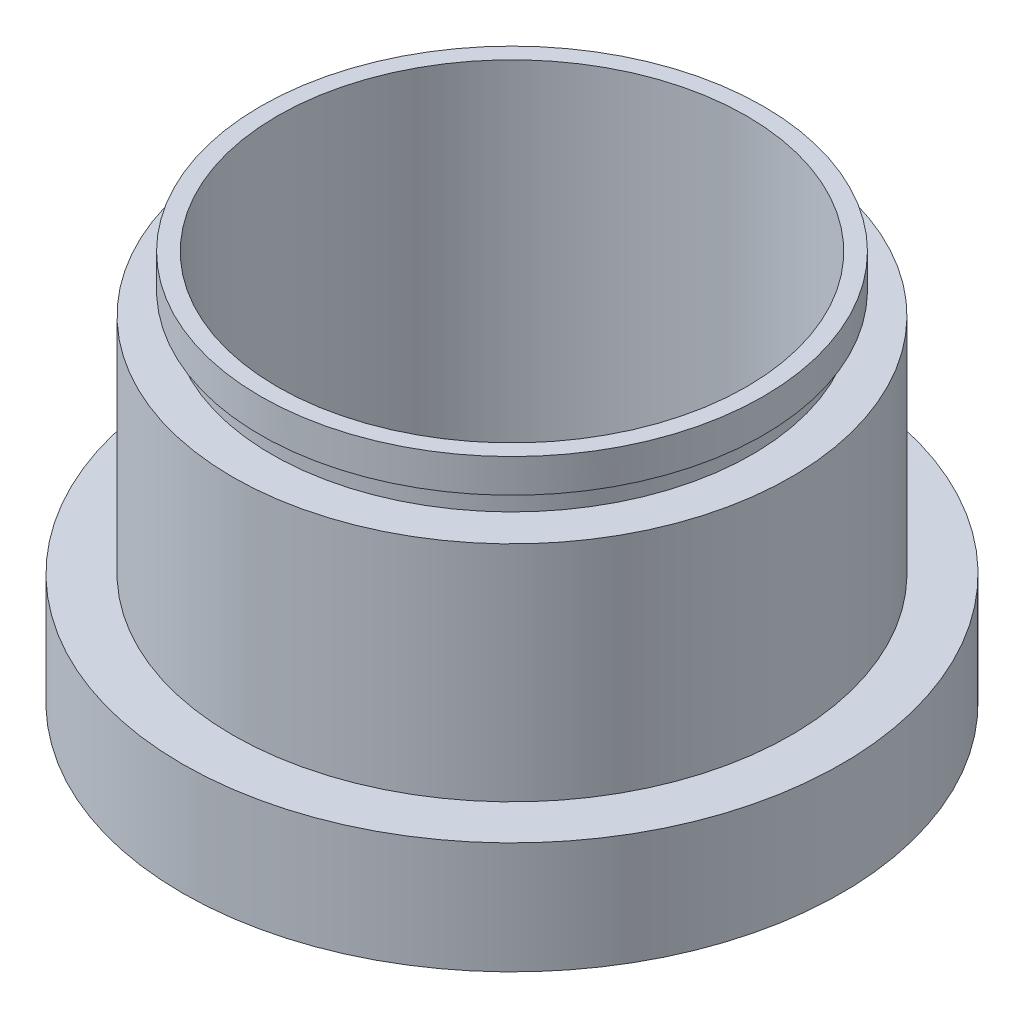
from build123d import *

# Parameters (mm, degrees)
SKETCH1_R           = 29.5
BOSS_EXTRUDE1_DEPTH = 10
SKETCH2_R           = 25
BOSS_EXTRUDE2_DEPTH = 20
SKETCH3_R           = 22.5
BOSS_EXTRUDE3_DEPTH = 5
SKETCH4_R           = 21
CUT_EXTRUDE1_DEPTH  = 55.456404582
SKETCH5_W           = 1
SKETCH5_H           = 2


with BuildPart() as part:
    # Sketch1 → Boss-Extrude1 (new body)
    with BuildSketch(Plane(origin=(0, 0, 0), x_dir=(1, 0, 0), z_dir=(0, 1, 0))):
        with Locations(Location((0, 0, 0), (0, 0, 270))):
            Circle(SKETCH1_R)
    extrude(amount=BOSS_EXTRUDE1_DEPTH)

    # Sketch2 → Boss-Extrude2 (add)
    with BuildSketch(Plane(origin=(0, 10, 0), x_dir=(1, 0, 0), z_dir=(0, 1, 0))):
        with Locations(Location((0, 0, 0), (0, 0, 270))):
            Circle(SKETCH2_R)
    extrude(amount=BOSS_EXTRUDE2_DEPTH)

    # Sketch3 → Boss-Extrude3 (add)
    with BuildSketch(Plane(origin=(0, 30, 0), x_dir=(1, 0, 0), z_dir=(0, 1, 0))):
        with Locations(Location((0, 0, 0), (0, 0, 270))):
            Circle(SKETCH3_R)
    extrude(amount=BOSS_EXTRUDE3_DEPTH)

    # Sketch4 → Cut-Extrude1 (cut, through all)
    with BuildSketch(Plane(origin=(0, 35, 0), x_dir=(1, 0, 0), z_dir=(0, 1, 0))):
        with Locations(Location((0, 0, 0), (0, 0, 270))):
            Circle(SKETCH4_R)
    extrude(amount=-CUT_EXTRUDE1_DEPTH, mode=Mode.SUBTRACT)

    # Sketch5 → Cut-Revolve1 (revolve, cut)
    with BuildSketch(Plane(origin=(0, 0, 0), x_dir=(0, 0, -1), z_dir=(1, 0, 0)), mode=Mode.PRIVATE) as cut_revolve1_sk:
        with Locations((-22, 31)):
            Rectangle(SKETCH5_W, SKETCH5_H)
    revolve(cut_revolve1_sk.sketch.rotate(Axis((0, 0, 0), (0, 1, 0)), 180), axis=Axis((0, 0, 0), (0, 1, 0)), mode=Mode.SUBTRACT)


solid = part.part
